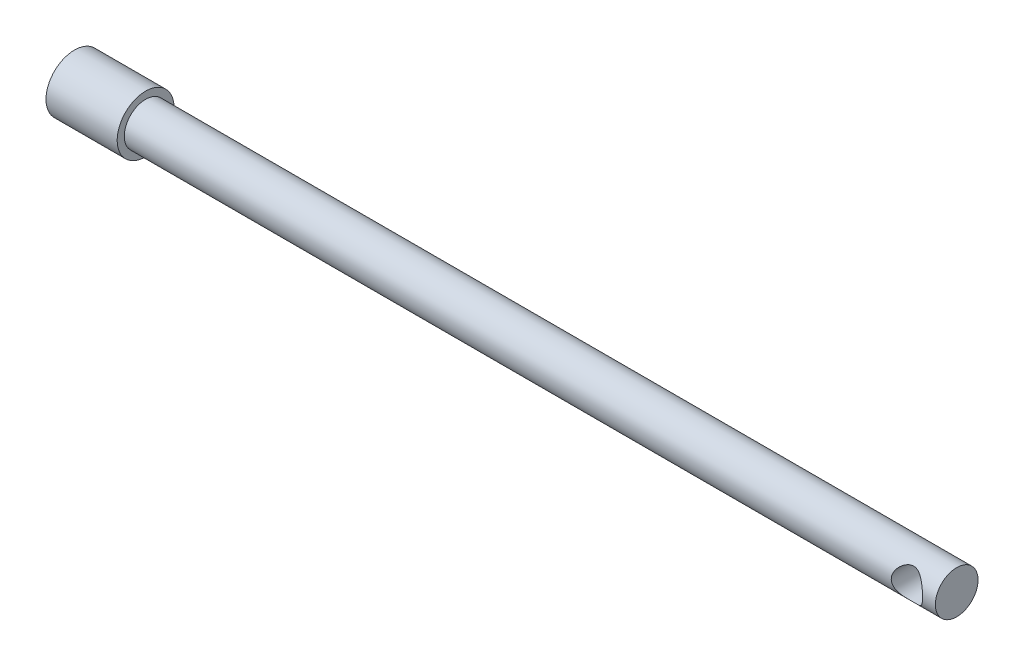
ISO-10303-21;
HEADER;
FILE_DESCRIPTION(('STEP AP214'),'2;1');
FILE_NAME('part.step','',(''),(''),'','','');
FILE_SCHEMA(('AUTOMOTIVE_DESIGN { 1 0 10303 214 1 1 1 1 }'));
ENDSEC;
DATA;
#1=APPLICATION_CONTEXT('core data for automotive mechanical design processes');
#2=APPLICATION_PROTOCOL_DEFINITION('international standard','automotive_design',2000,#1);
#3=PRODUCT_CONTEXT('',#1,'mechanical');
#4=PRODUCT('Part','Part','',(#3));
#5=PRODUCT_RELATED_PRODUCT_CATEGORY('part','',(#4));
#6=PRODUCT_DEFINITION_FORMATION('','',#4);
#7=PRODUCT_DEFINITION_CONTEXT('part definition',#1,'design');
#8=PRODUCT_DEFINITION('design','',#6,#7);
#9=PRODUCT_DEFINITION_SHAPE('','',#8);
#10=(LENGTH_UNIT() NAMED_UNIT(*) SI_UNIT(.MILLI.,.METRE.));
#11=(NAMED_UNIT(*) PLANE_ANGLE_UNIT() SI_UNIT($,.RADIAN.));
#12=(NAMED_UNIT(*) SI_UNIT($,.STERADIAN.) SOLID_ANGLE_UNIT());
#13=UNCERTAINTY_MEASURE_WITH_UNIT(LENGTH_MEASURE(1.E-05),#10,'distance_accuracy_value','');
#14=(GEOMETRIC_REPRESENTATION_CONTEXT(3) GLOBAL_UNCERTAINTY_ASSIGNED_CONTEXT((#13)) GLOBAL_UNIT_ASSIGNED_CONTEXT((#10,
#11,#12)) REPRESENTATION_CONTEXT('',''));
#15=CARTESIAN_POINT('',(0.,0.,0.));
#16=DIRECTION('',(0.,0.,1.));
#17=DIRECTION('',(1.,0.,0.));
#18=AXIS2_PLACEMENT_3D('',#15,#16,#17);
#19=CARTESIAN_POINT('',(-600.,0.,0.));
#20=DIRECTION('',(1.,0.,0.));
#21=DIRECTION('',(0.,0.,-1.));
#22=AXIS2_PLACEMENT_3D('',#19,#20,#21);
#23=PLANE('',#22);
#24=CARTESIAN_POINT('',(-600.,0.,0.));
#25=DIRECTION('',(-1.,0.,0.));
#26=DIRECTION('',(0.,0.,1.));
#27=AXIS2_PLACEMENT_3D('',#24,#25,#26);
#28=CIRCLE('',#27,20.);
#29=CARTESIAN_POINT('',(-600.,0.,20.));
#30=VERTEX_POINT('',#29);
#31=EDGE_CURVE('E18',#30,#30,#28,.F.);
#32=ORIENTED_EDGE('',*,*,#31,.F.);
#33=EDGE_LOOP('',(#32));
#34=FACE_BOUND('',#33,.T.);
#35=ADVANCED_FACE('F13',(#34),#23,.F.);
#36=CARTESIAN_POINT('',(-550.,0.,0.));
#37=DIRECTION('',(-1.,0.,0.));
#38=DIRECTION('',(0.,0.,1.));
#39=AXIS2_PLACEMENT_3D('',#36,#37,#38);
#40=CYLINDRICAL_SURFACE('',#39,20.);
#41=ORIENTED_EDGE('',*,*,#31,.T.);
#42=EDGE_LOOP('',(#41));
#43=FACE_BOUND('',#42,.T.);
#44=CARTESIAN_POINT('',(-550.,0.,0.));
#45=DIRECTION('',(-1.,0.,0.));
#46=DIRECTION('',(0.,0.,1.));
#47=AXIS2_PLACEMENT_3D('',#44,#45,#46);
#48=CIRCLE('',#47,20.);
#49=CARTESIAN_POINT('',(-550.,0.,20.));
#50=VERTEX_POINT('',#49);
#51=EDGE_CURVE('E46',#50,#50,#48,.T.);
#52=ORIENTED_EDGE('',*,*,#51,.T.);
#53=EDGE_LOOP('',(#52));
#54=FACE_BOUND('',#53,.T.);
#55=ADVANCED_FACE('F53',(#43,#54),#40,.T.);
#56=CARTESIAN_POINT('',(20.,0.,0.));
#57=DIRECTION('',(1.,0.,0.));
#58=DIRECTION('',(0.,0.,-1.));
#59=AXIS2_PLACEMENT_3D('',#56,#57,#58);
#60=PLANE('',#59);
#61=CARTESIAN_POINT('',(20.,0.,0.));
#62=DIRECTION('',(-1.,0.,0.));
#63=DIRECTION('',(0.,0.,1.));
#64=AXIS2_PLACEMENT_3D('',#61,#62,#63);
#65=CIRCLE('',#64,15.);
#66=CARTESIAN_POINT('',(20.,0.,15.));
#67=VERTEX_POINT('',#66);
#68=EDGE_CURVE('E44',#67,#67,#65,.T.);
#69=ORIENTED_EDGE('',*,*,#68,.F.);
#70=EDGE_LOOP('',(#69));
#71=FACE_BOUND('',#70,.T.);
#72=ADVANCED_FACE('F61',(#71),#60,.T.);
#73=CARTESIAN_POINT('',(-550.,0.,0.));
#74=DIRECTION('',(-1.,0.,0.));
#75=DIRECTION('',(0.,0.,1.));
#76=AXIS2_PLACEMENT_3D('',#73,#74,#75);
#77=PLANE('',#76);
#78=CARTESIAN_POINT('',(-550.,0.,0.));
#79=DIRECTION('',(-1.,0.,0.));
#80=DIRECTION('',(0.,0.,1.));
#81=AXIS2_PLACEMENT_3D('',#78,#79,#80);
#82=CIRCLE('',#81,15.);
#83=CARTESIAN_POINT('',(-550.,0.,15.));
#84=VERTEX_POINT('',#83);
#85=EDGE_CURVE('E22',#84,#84,#82,.F.);
#86=ORIENTED_EDGE('',*,*,#85,.F.);
#87=EDGE_LOOP('',(#86));
#88=FACE_BOUND('',#87,.T.);
#89=ORIENTED_EDGE('',*,*,#51,.F.);
#90=EDGE_LOOP('',(#89));
#91=FACE_BOUND('',#90,.T.);
#92=ADVANCED_FACE('F36',(#88,#91),#77,.F.);
#93=CARTESIAN_POINT('',(0.,0.,-15.));
#94=DIRECTION('',(0.,0.,1.));
#95=DIRECTION('',(1.,0.,0.));
#96=AXIS2_PLACEMENT_3D('',#93,#94,#95);
#97=CYLINDRICAL_SURFACE('',#96,11.);
#98=CARTESIAN_POINT('',(11.,0.,-15.));
#99=CARTESIAN_POINT('',(10.9999989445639,0.270234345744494,-14.9999989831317));
#100=CARTESIAN_POINT('',(10.9900265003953,0.540485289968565,-14.9926814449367));
#101=CARTESIAN_POINT('',(10.950295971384,1.07885095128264,-14.963582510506));
#102=CARTESIAN_POINT('',(10.9205289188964,1.34696464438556,-14.9417945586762));
#103=CARTESIAN_POINT('',(10.8416275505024,1.87926318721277,-14.8842251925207));
#104=CARTESIAN_POINT('',(10.792460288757,2.14344055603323,-14.8484199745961));
#105=CARTESIAN_POINT('',(10.6755308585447,2.66544248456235,-14.7636492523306));
#106=CARTESIAN_POINT('',(10.60777051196,2.92326766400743,-14.7146850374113));
#107=CARTESIAN_POINT('',(10.455056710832,3.42947281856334,-14.6049788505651));
#108=CARTESIAN_POINT('',(10.3702054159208,3.67789896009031,-14.5443069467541));
#109=CARTESIAN_POINT('',(10.1841148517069,4.16556445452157,-14.4122135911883));
#110=CARTESIAN_POINT('',(10.0828752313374,4.40480361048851,-14.3407919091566));
#111=CARTESIAN_POINT('',(9.86513916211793,4.87295052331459,-14.1885487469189));
#112=CARTESIAN_POINT('',(9.7486501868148,5.10186326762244,-14.1077318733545));
#113=CARTESIAN_POINT('',(9.50137535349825,5.5487947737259,-13.9380072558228));
#114=CARTESIAN_POINT('',(9.37058417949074,5.76680944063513,-13.8490965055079));
#115=CARTESIAN_POINT('',(9.08316785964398,6.21065135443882,-13.6561916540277));
#116=CARTESIAN_POINT('',(8.92527466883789,6.4353804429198,-13.5515613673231));
#117=CARTESIAN_POINT('',(8.59474679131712,6.8705899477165,-13.3361895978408));
#118=CARTESIAN_POINT('',(8.42211168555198,7.08106995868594,-13.2254479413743));
#119=CARTESIAN_POINT('',(8.06272673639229,7.48773584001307,-12.9995381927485));
#120=CARTESIAN_POINT('',(7.87595550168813,7.68389912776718,-12.8843635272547));
#121=CARTESIAN_POINT('',(7.48928883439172,8.06123556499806,-12.6517037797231));
#122=CARTESIAN_POINT('',(7.28939585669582,8.242411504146,-12.5342191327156));
#123=CARTESIAN_POINT('',(6.83682363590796,8.62331346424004,-12.2760403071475));
#124=CARTESIAN_POINT('',(6.58144005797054,8.81979231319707,-12.1352768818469));
#125=CARTESIAN_POINT('',(6.05311944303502,9.19042440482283,-11.8570571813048));
#126=CARTESIAN_POINT('',(5.7801773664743,9.36457119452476,-11.7196018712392));
#127=CARTESIAN_POINT('',(5.21744212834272,9.68936187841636,-11.4525286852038));
#128=CARTESIAN_POINT('',(4.92766801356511,9.84003165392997,-11.3229022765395));
#129=CARTESIAN_POINT('',(4.33141573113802,10.1166556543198,-11.076442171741));
#130=CARTESIAN_POINT('',(4.02494703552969,10.242623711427,-10.9596013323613));
#131=CARTESIAN_POINT('',(3.50094853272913,10.4303850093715,-10.7804394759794));
#132=CARTESIAN_POINT('',(3.28782250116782,10.4995737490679,-10.7129270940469));
#133=CARTESIAN_POINT('',(2.85500800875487,10.625426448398,-10.5881143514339));
#134=CARTESIAN_POINT('',(2.6353216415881,10.6820943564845,-10.5308107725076));
#135=CARTESIAN_POINT('',(2.19056026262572,10.7820819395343,-10.4284147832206));
#136=CARTESIAN_POINT('',(1.9654960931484,10.8254263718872,-10.3832997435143));
#137=CARTESIAN_POINT('',(1.51077883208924,10.8981901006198,-10.3069029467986));
#138=CARTESIAN_POINT('',(1.28112576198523,10.9276094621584,-10.2756211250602));
#139=CARTESIAN_POINT('',(0.817016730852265,10.9721120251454,-10.2280907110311));
#140=CARTESIAN_POINT('',(0.582537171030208,10.9870802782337,-10.2119626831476));
#141=CARTESIAN_POINT('',(0.112548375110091,11.0019364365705,-10.1959559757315));
#142=CARTESIAN_POINT('',(-0.122960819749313,11.0018249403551,-10.1960766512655));
#143=CARTESIAN_POINT('',(-0.593049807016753,10.9865203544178,-10.2125654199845));
#144=CARTESIAN_POINT('',(-0.827628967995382,10.9713183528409,-10.2289431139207));
#145=CARTESIAN_POINT('',(-1.29374843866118,10.9261645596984,-10.2771594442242));
#146=CARTESIAN_POINT('',(-1.52528840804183,10.8962111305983,-10.3089997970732));
#147=CARTESIAN_POINT('',(-2.00856310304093,10.8181280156,-10.3909399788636));
#148=CARTESIAN_POINT('',(-2.25976351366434,10.7683789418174,-10.4426460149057));
#149=CARTESIAN_POINT('',(-2.75472374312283,10.6525201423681,-10.5608080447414));
#150=CARTESIAN_POINT('',(-2.99848250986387,10.5864081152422,-10.6272661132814));
#151=CARTESIAN_POINT('',(-3.71799960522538,10.3647718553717,-10.8450088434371));
#152=CARTESIAN_POINT('',(-4.18133061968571,10.1860595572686,-11.0145361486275));
#153=CARTESIAN_POINT('',(-4.92554456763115,9.84116811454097,-11.3219366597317));
#154=CARTESIAN_POINT('',(-5.2168211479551,9.68975954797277,-11.4522158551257));
#155=CARTESIAN_POINT('',(-5.78225957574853,9.36333004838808,-11.7206082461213));
#156=CARTESIAN_POINT('',(-6.05641582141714,9.18830144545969,-11.8587239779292));
#157=CARTESIAN_POINT('',(-6.58728128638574,8.81550158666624,-12.1384232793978));
#158=CARTESIAN_POINT('',(-6.8439744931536,8.61770989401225,-12.2800098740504));
#159=CARTESIAN_POINT('',(-7.33908375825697,8.20016329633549,-12.562678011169));
#160=CARTESIAN_POINT('',(-7.57750193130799,7.9804109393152,-12.7037596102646));
#161=CARTESIAN_POINT('',(-8.03836541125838,7.51619216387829,-12.9838893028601));
#162=CARTESIAN_POINT('',(-8.26054003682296,7.27142254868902,-13.1228811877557));
#163=CARTESIAN_POINT('',(-8.68379183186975,6.76031353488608,-13.3933474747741));
#164=CARTESIAN_POINT('',(-8.88486659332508,6.4939716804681,-13.5248210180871));
#165=CARTESIAN_POINT('',(-9.26374282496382,5.9409781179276,-13.7766812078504));
#166=CARTESIAN_POINT('',(-9.44158119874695,5.65435975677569,-13.8970853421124));
#167=CARTESIAN_POINT('',(-9.7721047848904,5.06171559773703,-14.1237235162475));
#168=CARTESIAN_POINT('',(-9.92480016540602,4.75569771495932,-14.2299632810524));
#169=CARTESIAN_POINT('',(-10.1671126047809,4.20659794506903,-14.4001660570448));
#170=CARTESIAN_POINT('',(-10.2628788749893,3.96740850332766,-14.4679959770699));
#171=CARTESIAN_POINT('',(-10.4380921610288,3.48039642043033,-14.5928058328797));
#172=CARTESIAN_POINT('',(-10.5175428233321,3.2325757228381,-14.649788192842));
#173=CARTESIAN_POINT('',(-10.659004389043,2.73012906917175,-14.7516769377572));
#174=CARTESIAN_POINT('',(-10.7210502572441,2.47551789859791,-14.7966075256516));
#175=CARTESIAN_POINT('',(-10.8270300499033,1.96072320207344,-14.8735755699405));
#176=CARTESIAN_POINT('',(-10.87097136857,1.70054199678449,-14.9056182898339));
#177=CARTESIAN_POINT('',(-10.9368839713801,1.20084572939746,-14.953761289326));
#178=CARTESIAN_POINT('',(-10.9605217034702,0.961665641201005,-14.9710694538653));
#179=CARTESIAN_POINT('',(-10.9920819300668,0.481661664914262,-14.994190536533));
#180=CARTESIAN_POINT('',(-11.0000009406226,0.240837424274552,-15.0000009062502));
#181=CARTESIAN_POINT('',(-10.9999989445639,-0.270234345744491,-14.9999989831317));
#182=CARTESIAN_POINT('',(-10.9900265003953,-0.540485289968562,-14.9926814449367));
#183=CARTESIAN_POINT('',(-10.950295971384,-1.07885095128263,-14.963582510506));
#184=CARTESIAN_POINT('',(-10.9205289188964,-1.34696464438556,-14.9417945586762));
#185=CARTESIAN_POINT('',(-10.8416275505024,-1.87926318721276,-14.8842251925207));
#186=CARTESIAN_POINT('',(-10.792460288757,-2.14344055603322,-14.8484199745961));
#187=CARTESIAN_POINT('',(-10.6755308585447,-2.66544248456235,-14.7636492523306));
#188=CARTESIAN_POINT('',(-10.60777051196,-2.92326766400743,-14.7146850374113));
#189=CARTESIAN_POINT('',(-10.455056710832,-3.42947281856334,-14.6049788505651));
#190=CARTESIAN_POINT('',(-10.3702054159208,-3.67789896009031,-14.5443069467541));
#191=CARTESIAN_POINT('',(-10.1841148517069,-4.16556445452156,-14.4122135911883));
#192=CARTESIAN_POINT('',(-10.0828752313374,-4.40480361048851,-14.3407919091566));
#193=CARTESIAN_POINT('',(-9.86513916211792,-4.87295052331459,-14.1885487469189));
#194=CARTESIAN_POINT('',(-9.7486501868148,-5.10186326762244,-14.1077318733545));
#195=CARTESIAN_POINT('',(-9.50137535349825,-5.5487947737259,-13.9380072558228));
#196=CARTESIAN_POINT('',(-9.37058417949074,-5.76680944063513,-13.8490965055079));
#197=CARTESIAN_POINT('',(-9.08316785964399,-6.21065135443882,-13.6561916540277));
#198=CARTESIAN_POINT('',(-8.92527466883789,-6.4353804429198,-13.5515613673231));
#199=CARTESIAN_POINT('',(-8.59474679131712,-6.8705899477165,-13.3361895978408));
#200=CARTESIAN_POINT('',(-8.42211168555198,-7.08106995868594,-13.2254479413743));
#201=CARTESIAN_POINT('',(-8.06272673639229,-7.48773584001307,-12.9995381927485));
#202=CARTESIAN_POINT('',(-7.87595550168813,-7.68389912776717,-12.8843635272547));
#203=CARTESIAN_POINT('',(-7.48928883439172,-8.06123556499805,-12.6517037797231));
#204=CARTESIAN_POINT('',(-7.28939585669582,-8.242411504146,-12.5342191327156));
#205=CARTESIAN_POINT('',(-6.83682363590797,-8.62331346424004,-12.2760403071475));
#206=CARTESIAN_POINT('',(-6.58144005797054,-8.81979231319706,-12.1352768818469));
#207=CARTESIAN_POINT('',(-6.05311944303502,-9.19042440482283,-11.8570571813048));
#208=CARTESIAN_POINT('',(-5.78017736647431,-9.36457119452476,-11.7196018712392));
#209=CARTESIAN_POINT('',(-5.21744212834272,-9.68936187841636,-11.4525286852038));
#210=CARTESIAN_POINT('',(-4.92766801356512,-9.84003165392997,-11.3229022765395));
#211=CARTESIAN_POINT('',(-4.33141573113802,-10.1166556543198,-11.076442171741));
#212=CARTESIAN_POINT('',(-4.02494703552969,-10.242623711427,-10.9596013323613));
#213=CARTESIAN_POINT('',(-3.50094853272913,-10.4303850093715,-10.7804394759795));
#214=CARTESIAN_POINT('',(-3.28782250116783,-10.4995737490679,-10.7129270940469));
#215=CARTESIAN_POINT('',(-2.85500800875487,-10.625426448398,-10.5881143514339));
#216=CARTESIAN_POINT('',(-2.63532164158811,-10.6820943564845,-10.5308107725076));
#217=CARTESIAN_POINT('',(-2.19056026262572,-10.7820819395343,-10.4284147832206));
#218=CARTESIAN_POINT('',(-1.9654960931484,-10.8254263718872,-10.3832997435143));
#219=CARTESIAN_POINT('',(-1.51077883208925,-10.8981901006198,-10.3069029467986));
#220=CARTESIAN_POINT('',(-1.28112576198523,-10.9276094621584,-10.2756211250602));
#221=CARTESIAN_POINT('',(-0.817016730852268,-10.9721120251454,-10.2280907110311));
#222=CARTESIAN_POINT('',(-0.582537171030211,-10.9870802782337,-10.2119626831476));
#223=CARTESIAN_POINT('',(-0.112548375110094,-11.0019364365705,-10.1959559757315));
#224=CARTESIAN_POINT('',(0.12296081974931,-11.0018249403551,-10.1960766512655));
#225=CARTESIAN_POINT('',(0.593049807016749,-10.9865203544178,-10.2125654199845));
#226=CARTESIAN_POINT('',(0.827628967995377,-10.9713183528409,-10.2289431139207));
#227=CARTESIAN_POINT('',(1.29374843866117,-10.9261645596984,-10.2771594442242));
#228=CARTESIAN_POINT('',(1.52528840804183,-10.8962111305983,-10.3089997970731));
#229=CARTESIAN_POINT('',(2.00856310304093,-10.8181280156,-10.3909399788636));
#230=CARTESIAN_POINT('',(2.25976351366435,-10.7683789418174,-10.4426460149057));
#231=CARTESIAN_POINT('',(2.75472374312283,-10.652520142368,-10.5608080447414));
#232=CARTESIAN_POINT('',(2.99848250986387,-10.5864081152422,-10.6272661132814));
#233=CARTESIAN_POINT('',(3.71799960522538,-10.3647718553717,-10.8450088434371));
#234=CARTESIAN_POINT('',(4.1813306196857,-10.1860595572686,-11.0145361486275));
#235=CARTESIAN_POINT('',(4.92554456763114,-9.84116811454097,-11.3219366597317));
#236=CARTESIAN_POINT('',(5.21682114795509,-9.68975954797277,-11.4522158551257));
#237=CARTESIAN_POINT('',(5.78225957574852,-9.36333004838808,-11.7206082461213));
#238=CARTESIAN_POINT('',(6.05641582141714,-9.1883014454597,-11.8587239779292));
#239=CARTESIAN_POINT('',(6.58728128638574,-8.81550158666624,-12.1384232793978));
#240=CARTESIAN_POINT('',(6.84397449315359,-8.61770989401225,-12.2800098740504));
#241=CARTESIAN_POINT('',(7.33908375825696,-8.20016329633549,-12.562678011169));
#242=CARTESIAN_POINT('',(7.57750193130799,-7.9804109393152,-12.7037596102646));
#243=CARTESIAN_POINT('',(8.03836541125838,-7.51619216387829,-12.9838893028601));
#244=CARTESIAN_POINT('',(8.26054003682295,-7.27142254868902,-13.1228811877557));
#245=CARTESIAN_POINT('',(8.68379183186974,-6.76031353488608,-13.3933474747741));
#246=CARTESIAN_POINT('',(8.88486659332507,-6.49397168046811,-13.5248210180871));
#247=CARTESIAN_POINT('',(9.26374282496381,-5.94097811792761,-13.7766812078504));
#248=CARTESIAN_POINT('',(9.44158119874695,-5.6543597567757,-13.8970853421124));
#249=CARTESIAN_POINT('',(9.7721047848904,-5.06171559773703,-14.1237235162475));
#250=CARTESIAN_POINT('',(9.92480016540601,-4.75569771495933,-14.2299632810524));
#251=CARTESIAN_POINT('',(10.1671126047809,-4.20659794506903,-14.4001660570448));
#252=CARTESIAN_POINT('',(10.2628788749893,-3.96740850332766,-14.4679959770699));
#253=CARTESIAN_POINT('',(10.4380921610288,-3.48039642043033,-14.5928058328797));
#254=CARTESIAN_POINT('',(10.5175428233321,-3.2325757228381,-14.649788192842));
#255=CARTESIAN_POINT('',(10.659004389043,-2.73012906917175,-14.7516769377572));
#256=CARTESIAN_POINT('',(10.7210502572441,-2.47551789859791,-14.7966075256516));
#257=CARTESIAN_POINT('',(10.8270300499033,-1.96072320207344,-14.8735755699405));
#258=CARTESIAN_POINT('',(10.87097136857,-1.7005419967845,-14.9056182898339));
#259=CARTESIAN_POINT('',(10.9368839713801,-1.20084572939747,-14.953761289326));
#260=CARTESIAN_POINT('',(10.9605217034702,-0.961665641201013,-14.9710694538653));
#261=CARTESIAN_POINT('',(10.9920819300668,-0.481661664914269,-14.994190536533));
#262=CARTESIAN_POINT('',(11.0000009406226,-0.240837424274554,-15.0000009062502));
#263=CARTESIAN_POINT('',(11.,0.,-15.));
#264=B_SPLINE_CURVE_WITH_KNOTS('',3,(#98,#99,#100,#101,#102,#103,#104,#105,#106,#107,#108,#109,
#110,#111,#112,#113,#114,#115,#116,#117,#118,#119,#120,#121,#122,#123,#124,#125,#126,#127,#128,
#129,#130,#131,#132,#133,#134,#135,#136,#137,#138,#139,#140,#141,#142,#143,#144,#145,#146,#147,
#148,#149,#150,#151,#152,#153,#154,#155,#156,#157,#158,#159,#160,#161,#162,#163,#164,#165,#166,
#167,#168,#169,#170,#171,#172,#173,#174,#175,#176,#177,#178,#179,#180,#181,#182,#183,#184,#185,
#186,#187,#188,#189,#190,#191,#192,#193,#194,#195,#196,#197,#198,#199,#200,#201,#202,#203,#204,
#205,#206,#207,#208,#209,#210,#211,#212,#213,#214,#215,#216,#217,#218,#219,#220,#221,#222,#223,
#224,#225,#226,#227,#228,#229,#230,#231,#232,#233,#234,#235,#236,#237,#238,#239,#240,#241,#242,
#243,#244,#245,#246,#247,#248,#249,#250,#251,#252,#253,#254,#255,#256,#257,#258,#259,#260,#261,
#262,#263),.UNSPECIFIED.,.T.,.F.,(4,2,2,2,2,2,2,2,2,2,2,2,2,2,2,2,2,2,2,2,2,2,2,2,2,2,2,2,2,2,2,
2,2,2,2,2,2,2,2,2,2,2,2,2,2,2,2,2,2,2,2,2,2,2,2,2,2,2,2,2,2,2,2,2,2,2,2,2,2,2,2,2,2,2,2,2,2,2,2,
2,2,2,4),(0.,0.810451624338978,1.62127066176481,2.43347261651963,3.245595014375,
4.05299986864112,4.86042202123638,5.66744993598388,6.4747788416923,7.35566894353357,
8.23658409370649,9.11886000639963,10.0009713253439,11.0546742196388,12.1086809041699,
13.1615172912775,14.2137624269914,14.9152774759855,15.6165709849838,16.3165533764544,
17.0165324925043,17.7220346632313,18.4275088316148,19.1333998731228,19.8393692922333,
20.6219293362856,21.4045995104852,22.9719812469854,24.0304577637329,25.0892788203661,
26.1490580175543,27.2087143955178,28.2832214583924,29.3578510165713,30.4307525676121,
31.5032191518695,32.301720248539,33.100042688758,33.8967496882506,34.6931309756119,
35.4152591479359,36.1375473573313,36.9479989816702,37.7588180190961,38.5710199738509,
39.3831423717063,40.1905472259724,40.9979693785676,41.8049972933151,42.6123261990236,
43.4932163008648,44.3741314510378,45.2564073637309,46.1385186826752,47.1922215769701,
48.2462282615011,49.2990646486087,50.3513097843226,51.0528248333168,51.7541183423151,
52.4541007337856,53.1540798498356,53.8595820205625,54.5650561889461,55.2709472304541,
55.9769166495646,56.7594766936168,57.5421468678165,59.1095286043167,60.1680051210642,
61.2268261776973,62.2866053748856,63.3462617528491,64.4207688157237,65.4953983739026,
66.5682999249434,67.6407665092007,68.4392676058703,69.2375900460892,70.0342970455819,
70.8306783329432,71.5528065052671,72.2750947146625),.UNSPECIFIED.);
#265=CARTESIAN_POINT('',(11.,0.,-15.));
#266=VERTEX_POINT('',#265);
#267=EDGE_CURVE('E27',#266,#266,#264,.T.);
#268=ORIENTED_EDGE('',*,*,#267,.F.);
#269=EDGE_LOOP('',(#268));
#270=FACE_BOUND('',#269,.T.);
#271=CARTESIAN_POINT('',(-11.,0.,15.));
#272=CARTESIAN_POINT('',(-10.9999989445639,0.270234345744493,14.9999989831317));
#273=CARTESIAN_POINT('',(-10.9900265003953,0.540485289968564,14.9926814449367));
#274=CARTESIAN_POINT('',(-10.950295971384,1.07885095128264,14.963582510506));
#275=CARTESIAN_POINT('',(-10.9205289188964,1.34696464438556,14.9417945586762));
#276=CARTESIAN_POINT('',(-10.8416275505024,1.87926318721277,14.8842251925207));
#277=CARTESIAN_POINT('',(-10.792460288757,2.14344055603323,14.8484199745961));
#278=CARTESIAN_POINT('',(-10.6755308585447,2.66544248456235,14.7636492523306));
#279=CARTESIAN_POINT('',(-10.60777051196,2.92326766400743,14.7146850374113));
#280=CARTESIAN_POINT('',(-10.455056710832,3.42947281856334,14.6049788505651));
#281=CARTESIAN_POINT('',(-10.3702054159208,3.67789896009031,14.5443069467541));
#282=CARTESIAN_POINT('',(-10.1841148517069,4.16556445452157,14.4122135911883));
#283=CARTESIAN_POINT('',(-10.0828752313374,4.40480361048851,14.3407919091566));
#284=CARTESIAN_POINT('',(-9.86513916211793,4.87295052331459,14.1885487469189));
#285=CARTESIAN_POINT('',(-9.7486501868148,5.10186326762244,14.1077318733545));
#286=CARTESIAN_POINT('',(-9.50137535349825,5.5487947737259,13.9380072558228));
#287=CARTESIAN_POINT('',(-9.37058417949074,5.76680944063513,13.8490965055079));
#288=CARTESIAN_POINT('',(-9.08316785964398,6.21065135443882,13.6561916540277));
#289=CARTESIAN_POINT('',(-8.92527466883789,6.4353804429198,13.5515613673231));
#290=CARTESIAN_POINT('',(-8.59474679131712,6.8705899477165,13.3361895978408));
#291=CARTESIAN_POINT('',(-8.42211168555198,7.08106995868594,13.2254479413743));
#292=CARTESIAN_POINT('',(-8.06272673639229,7.48773584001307,12.9995381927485));
#293=CARTESIAN_POINT('',(-7.87595550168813,7.68389912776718,12.8843635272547));
#294=CARTESIAN_POINT('',(-7.48928883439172,8.06123556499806,12.6517037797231));
#295=CARTESIAN_POINT('',(-7.28939585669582,8.242411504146,12.5342191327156));
#296=CARTESIAN_POINT('',(-6.83682363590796,8.62331346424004,12.2760403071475));
#297=CARTESIAN_POINT('',(-6.58144005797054,8.81979231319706,12.1352768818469));
#298=CARTESIAN_POINT('',(-6.05311944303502,9.19042440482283,11.8570571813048));
#299=CARTESIAN_POINT('',(-5.7801773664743,9.36457119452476,11.7196018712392));
#300=CARTESIAN_POINT('',(-5.21744212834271,9.68936187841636,11.4525286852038));
#301=CARTESIAN_POINT('',(-4.92766801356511,9.84003165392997,11.3229022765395));
#302=CARTESIAN_POINT('',(-4.33141573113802,10.1166556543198,11.076442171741));
#303=CARTESIAN_POINT('',(-4.02494703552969,10.242623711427,10.9596013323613));
#304=CARTESIAN_POINT('',(-3.50094853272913,10.4303850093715,10.7804394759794));
#305=CARTESIAN_POINT('',(-3.28782250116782,10.4995737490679,10.7129270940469));
#306=CARTESIAN_POINT('',(-2.85500800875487,10.625426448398,10.5881143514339));
#307=CARTESIAN_POINT('',(-2.6353216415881,10.6820943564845,10.5308107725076));
#308=CARTESIAN_POINT('',(-2.19056026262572,10.7820819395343,10.4284147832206));
#309=CARTESIAN_POINT('',(-1.9654960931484,10.8254263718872,10.3832997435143));
#310=CARTESIAN_POINT('',(-1.51077883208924,10.8981901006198,10.3069029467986));
#311=CARTESIAN_POINT('',(-1.28112576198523,10.9276094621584,10.2756211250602));
#312=CARTESIAN_POINT('',(-0.817016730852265,10.9721120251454,10.2280907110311));
#313=CARTESIAN_POINT('',(-0.582537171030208,10.9870802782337,10.2119626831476));
#314=CARTESIAN_POINT('',(-0.112548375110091,11.0019364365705,10.1959559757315));
#315=CARTESIAN_POINT('',(0.122960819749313,11.0018249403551,10.1960766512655));
#316=CARTESIAN_POINT('',(0.593049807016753,10.9865203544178,10.2125654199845));
#317=CARTESIAN_POINT('',(0.827628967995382,10.9713183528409,10.2289431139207));
#318=CARTESIAN_POINT('',(1.29374843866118,10.9261645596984,10.2771594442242));
#319=CARTESIAN_POINT('',(1.52528840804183,10.8962111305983,10.3089997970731));
#320=CARTESIAN_POINT('',(2.00856310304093,10.8181280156,10.3909399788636));
#321=CARTESIAN_POINT('',(2.25976351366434,10.7683789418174,10.4426460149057));
#322=CARTESIAN_POINT('',(2.75472374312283,10.652520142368,10.5608080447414));
#323=CARTESIAN_POINT('',(2.99848250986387,10.5864081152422,10.6272661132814));
#324=CARTESIAN_POINT('',(3.71799960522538,10.3647718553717,10.8450088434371));
#325=CARTESIAN_POINT('',(4.18133061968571,10.1860595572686,11.0145361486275));
#326=CARTESIAN_POINT('',(4.92554456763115,9.84116811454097,11.3219366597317));
#327=CARTESIAN_POINT('',(5.2168211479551,9.68975954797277,11.4522158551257));
#328=CARTESIAN_POINT('',(5.78225957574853,9.36333004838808,11.7206082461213));
#329=CARTESIAN_POINT('',(6.05641582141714,9.18830144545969,11.8587239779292));
#330=CARTESIAN_POINT('',(6.58728128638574,8.81550158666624,12.1384232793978));
#331=CARTESIAN_POINT('',(6.8439744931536,8.61770989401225,12.2800098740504));
#332=CARTESIAN_POINT('',(7.33908375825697,8.20016329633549,12.562678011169));
#333=CARTESIAN_POINT('',(7.57750193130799,7.9804109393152,12.7037596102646));
#334=CARTESIAN_POINT('',(8.03836541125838,7.51619216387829,12.9838893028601));
#335=CARTESIAN_POINT('',(8.26054003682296,7.27142254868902,13.1228811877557));
#336=CARTESIAN_POINT('',(8.68379183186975,6.76031353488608,13.3933474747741));
#337=CARTESIAN_POINT('',(8.88486659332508,6.4939716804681,13.5248210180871));
#338=CARTESIAN_POINT('',(9.26374282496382,5.9409781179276,13.7766812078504));
#339=CARTESIAN_POINT('',(9.44158119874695,5.65435975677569,13.8970853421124));
#340=CARTESIAN_POINT('',(9.7721047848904,5.06171559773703,14.1237235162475));
#341=CARTESIAN_POINT('',(9.92480016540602,4.75569771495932,14.2299632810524));
#342=CARTESIAN_POINT('',(10.1671126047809,4.20659794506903,14.4001660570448));
#343=CARTESIAN_POINT('',(10.2628788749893,3.96740850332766,14.4679959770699));
#344=CARTESIAN_POINT('',(10.4380921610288,3.48039642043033,14.5928058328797));
#345=CARTESIAN_POINT('',(10.5175428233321,3.2325757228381,14.649788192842));
#346=CARTESIAN_POINT('',(10.659004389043,2.73012906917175,14.7516769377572));
#347=CARTESIAN_POINT('',(10.7210502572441,2.47551789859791,14.7966075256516));
#348=CARTESIAN_POINT('',(10.8270300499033,1.96072320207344,14.8735755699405));
#349=CARTESIAN_POINT('',(10.87097136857,1.70054199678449,14.9056182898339));
#350=CARTESIAN_POINT('',(10.9368839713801,1.20084572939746,14.953761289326));
#351=CARTESIAN_POINT('',(10.9605217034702,0.961665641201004,14.9710694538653));
#352=CARTESIAN_POINT('',(10.9920819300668,0.48166166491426,14.994190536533));
#353=CARTESIAN_POINT('',(11.0000009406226,0.24083742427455,15.0000009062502));
#354=CARTESIAN_POINT('',(10.9999989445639,-0.270234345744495,14.9999989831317));
#355=CARTESIAN_POINT('',(10.9900265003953,-0.540485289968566,14.9926814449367));
#356=CARTESIAN_POINT('',(10.950295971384,-1.07885095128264,14.963582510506));
#357=CARTESIAN_POINT('',(10.9205289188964,-1.34696464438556,14.9417945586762));
#358=CARTESIAN_POINT('',(10.8416275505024,-1.87926318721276,14.8842251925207));
#359=CARTESIAN_POINT('',(10.792460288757,-2.14344055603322,14.8484199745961));
#360=CARTESIAN_POINT('',(10.6755308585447,-2.66544248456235,14.7636492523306));
#361=CARTESIAN_POINT('',(10.60777051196,-2.92326766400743,14.7146850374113));
#362=CARTESIAN_POINT('',(10.455056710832,-3.42947281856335,14.6049788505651));
#363=CARTESIAN_POINT('',(10.3702054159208,-3.67789896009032,14.5443069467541));
#364=CARTESIAN_POINT('',(10.1841148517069,-4.16556445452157,14.4122135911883));
#365=CARTESIAN_POINT('',(10.0828752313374,-4.40480361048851,14.3407919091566));
#366=CARTESIAN_POINT('',(9.86513916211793,-4.87295052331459,14.1885487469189));
#367=CARTESIAN_POINT('',(9.7486501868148,-5.10186326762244,14.1077318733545));
#368=CARTESIAN_POINT('',(9.50137535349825,-5.54879477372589,13.9380072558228));
#369=CARTESIAN_POINT('',(9.37058417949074,-5.76680944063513,13.8490965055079));
#370=CARTESIAN_POINT('',(9.08316785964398,-6.21065135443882,13.6561916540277));
#371=CARTESIAN_POINT('',(8.92527466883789,-6.4353804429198,13.5515613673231));
#372=CARTESIAN_POINT('',(8.59474679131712,-6.8705899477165,13.3361895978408));
#373=CARTESIAN_POINT('',(8.42211168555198,-7.08106995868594,13.2254479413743));
#374=CARTESIAN_POINT('',(8.06272673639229,-7.48773584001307,12.9995381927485));
#375=CARTESIAN_POINT('',(7.87595550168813,-7.68389912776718,12.8843635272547));
#376=CARTESIAN_POINT('',(7.48928883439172,-8.06123556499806,12.6517037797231));
#377=CARTESIAN_POINT('',(7.28939585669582,-8.242411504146,12.5342191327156));
#378=CARTESIAN_POINT('',(6.83682363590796,-8.62331346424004,12.2760403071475));
#379=CARTESIAN_POINT('',(6.58144005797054,-8.81979231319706,12.1352768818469));
#380=CARTESIAN_POINT('',(6.05311944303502,-9.19042440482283,11.8570571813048));
#381=CARTESIAN_POINT('',(5.78017736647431,-9.36457119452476,11.7196018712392));
#382=CARTESIAN_POINT('',(5.21744212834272,-9.68936187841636,11.4525286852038));
#383=CARTESIAN_POINT('',(4.92766801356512,-9.84003165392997,11.3229022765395));
#384=CARTESIAN_POINT('',(4.33141573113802,-10.1166556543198,11.076442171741));
#385=CARTESIAN_POINT('',(4.02494703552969,-10.242623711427,10.9596013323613));
#386=CARTESIAN_POINT('',(3.50094853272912,-10.4303850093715,10.7804394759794));
#387=CARTESIAN_POINT('',(3.28782250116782,-10.4995737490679,10.7129270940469));
#388=CARTESIAN_POINT('',(2.85500800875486,-10.625426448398,10.5881143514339));
#389=CARTESIAN_POINT('',(2.6353216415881,-10.6820943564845,10.5308107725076));
#390=CARTESIAN_POINT('',(2.19056026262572,-10.7820819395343,10.4284147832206));
#391=CARTESIAN_POINT('',(1.9654960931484,-10.8254263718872,10.3832997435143));
#392=CARTESIAN_POINT('',(1.51077883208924,-10.8981901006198,10.3069029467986));
#393=CARTESIAN_POINT('',(1.28112576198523,-10.9276094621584,10.2756211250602));
#394=CARTESIAN_POINT('',(0.817016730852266,-10.9721120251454,10.2280907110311));
#395=CARTESIAN_POINT('',(0.58253717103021,-10.9870802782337,10.2119626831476));
#396=CARTESIAN_POINT('',(0.112548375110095,-11.0019364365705,10.1959559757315));
#397=CARTESIAN_POINT('',(-0.122960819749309,-11.0018249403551,10.1960766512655));
#398=CARTESIAN_POINT('',(-0.59304980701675,-10.9865203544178,10.2125654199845));
#399=CARTESIAN_POINT('',(-0.82762896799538,-10.9713183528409,10.2289431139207));
#400=CARTESIAN_POINT('',(-1.29374843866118,-10.9261645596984,10.2771594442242));
#401=CARTESIAN_POINT('',(-1.52528840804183,-10.8962111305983,10.3089997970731));
#402=CARTESIAN_POINT('',(-2.00856310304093,-10.8181280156,10.3909399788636));
#403=CARTESIAN_POINT('',(-2.25976351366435,-10.7683789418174,10.4426460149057));
#404=CARTESIAN_POINT('',(-2.75472374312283,-10.652520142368,10.5608080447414));
#405=CARTESIAN_POINT('',(-2.99848250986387,-10.5864081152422,10.6272661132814));
#406=CARTESIAN_POINT('',(-3.71799960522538,-10.3647718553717,10.8450088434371));
#407=CARTESIAN_POINT('',(-4.1813306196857,-10.1860595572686,11.0145361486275));
#408=CARTESIAN_POINT('',(-4.92554456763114,-9.84116811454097,11.3219366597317));
#409=CARTESIAN_POINT('',(-5.2168211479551,-9.68975954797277,11.4522158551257));
#410=CARTESIAN_POINT('',(-5.78225957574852,-9.36333004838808,11.7206082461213));
#411=CARTESIAN_POINT('',(-6.05641582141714,-9.1883014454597,11.8587239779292));
#412=CARTESIAN_POINT('',(-6.58728128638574,-8.81550158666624,12.1384232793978));
#413=CARTESIAN_POINT('',(-6.8439744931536,-8.61770989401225,12.2800098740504));
#414=CARTESIAN_POINT('',(-7.33908375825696,-8.20016329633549,12.562678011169));
#415=CARTESIAN_POINT('',(-7.57750193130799,-7.9804109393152,12.7037596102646));
#416=CARTESIAN_POINT('',(-8.03836541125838,-7.51619216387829,12.9838893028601));
#417=CARTESIAN_POINT('',(-8.26054003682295,-7.27142254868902,13.1228811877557));
#418=CARTESIAN_POINT('',(-8.68379183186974,-6.76031353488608,13.3933474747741));
#419=CARTESIAN_POINT('',(-8.88486659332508,-6.4939716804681,13.524821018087));
#420=CARTESIAN_POINT('',(-9.26374282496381,-5.9409781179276,13.7766812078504));
#421=CARTESIAN_POINT('',(-9.44158119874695,-5.6543597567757,13.8970853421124));
#422=CARTESIAN_POINT('',(-9.7721047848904,-5.06171559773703,14.1237235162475));
#423=CARTESIAN_POINT('',(-9.92480016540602,-4.75569771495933,14.2299632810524));
#424=CARTESIAN_POINT('',(-10.1671126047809,-4.20659794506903,14.4001660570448));
#425=CARTESIAN_POINT('',(-10.2628788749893,-3.96740850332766,14.4679959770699));
#426=CARTESIAN_POINT('',(-10.4380921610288,-3.48039642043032,14.5928058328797));
#427=CARTESIAN_POINT('',(-10.5175428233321,-3.2325757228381,14.649788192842));
#428=CARTESIAN_POINT('',(-10.659004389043,-2.73012906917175,14.7516769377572));
#429=CARTESIAN_POINT('',(-10.7210502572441,-2.47551789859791,14.7966075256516));
#430=CARTESIAN_POINT('',(-10.8270300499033,-1.96072320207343,14.8735755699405));
#431=CARTESIAN_POINT('',(-10.87097136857,-1.70054199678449,14.9056182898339));
#432=CARTESIAN_POINT('',(-10.9368839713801,-1.20084572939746,14.953761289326));
#433=CARTESIAN_POINT('',(-10.9605217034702,-0.961665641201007,14.9710694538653));
#434=CARTESIAN_POINT('',(-10.9920819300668,-0.481661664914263,14.994190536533));
#435=CARTESIAN_POINT('',(-11.0000009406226,-0.240837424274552,15.0000009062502));
#436=CARTESIAN_POINT('',(-11.,0.,15.));
#437=B_SPLINE_CURVE_WITH_KNOTS('',3,(#271,#272,#273,#274,#275,#276,#277,#278,#279,#280,#281,
#282,#283,#284,#285,#286,#287,#288,#289,#290,#291,#292,#293,#294,#295,#296,#297,#298,#299,#300,
#301,#302,#303,#304,#305,#306,#307,#308,#309,#310,#311,#312,#313,#314,#315,#316,#317,#318,#319,
#320,#321,#322,#323,#324,#325,#326,#327,#328,#329,#330,#331,#332,#333,#334,#335,#336,#337,#338,
#339,#340,#341,#342,#343,#344,#345,#346,#347,#348,#349,#350,#351,#352,#353,#354,#355,#356,#357,
#358,#359,#360,#361,#362,#363,#364,#365,#366,#367,#368,#369,#370,#371,#372,#373,#374,#375,#376,
#377,#378,#379,#380,#381,#382,#383,#384,#385,#386,#387,#388,#389,#390,#391,#392,#393,#394,#395,
#396,#397,#398,#399,#400,#401,#402,#403,#404,#405,#406,#407,#408,#409,#410,#411,#412,#413,#414,
#415,#416,#417,#418,#419,#420,#421,#422,#423,#424,#425,#426,#427,#428,#429,#430,#431,#432,#433,
#434,#435,#436),.UNSPECIFIED.,.T.,.F.,(4,2,2,2,2,2,2,2,2,2,2,2,2,2,2,2,2,2,2,2,2,2,2,2,2,2,2,2,
2,2,2,2,2,2,2,2,2,2,2,2,2,2,2,2,2,2,2,2,2,2,2,2,2,2,2,2,2,2,2,2,2,2,2,2,2,2,2,2,2,2,2,2,2,2,2,2,
2,2,2,2,2,2,4),(0.,0.810451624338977,1.62127066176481,2.43347261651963,3.245595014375,
4.05299986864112,4.86042202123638,5.66744993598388,6.4747788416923,7.35566894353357,
8.23658409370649,9.11886000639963,10.0009713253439,11.0546742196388,12.1086809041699,
13.1615172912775,14.2137624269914,14.9152774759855,15.6165709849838,16.3165533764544,
17.0165324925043,17.7220346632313,18.4275088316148,19.1333998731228,19.8393692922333,
20.6219293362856,21.4045995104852,22.9719812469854,24.0304577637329,25.0892788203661,
26.1490580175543,27.2087143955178,28.2832214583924,29.3578510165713,30.4307525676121,
31.5032191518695,32.301720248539,33.100042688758,33.8967496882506,34.6931309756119,
35.4152591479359,36.1375473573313,36.9479989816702,37.7588180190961,38.5710199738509,
39.3831423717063,40.1905472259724,40.9979693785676,41.8049972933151,42.6123261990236,
43.4932163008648,44.3741314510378,45.2564073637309,46.1385186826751,47.1922215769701,
48.2462282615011,49.2990646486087,50.3513097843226,51.0528248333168,51.7541183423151,
52.4541007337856,53.1540798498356,53.8595820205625,54.5650561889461,55.2709472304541,
55.9769166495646,56.7594766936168,57.5421468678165,59.1095286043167,60.1680051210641,
61.2268261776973,62.2866053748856,63.346261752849,64.4207688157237,65.4953983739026,
66.5682999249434,67.6407665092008,68.4392676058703,69.2375900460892,70.0342970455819,
70.8306783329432,71.5528065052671,72.2750947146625),.UNSPECIFIED.);
#438=CARTESIAN_POINT('',(-11.,0.,15.));
#439=VERTEX_POINT('',#438);
#440=EDGE_CURVE('E9',#439,#439,#437,.T.);
#441=ORIENTED_EDGE('',*,*,#440,.F.);
#442=EDGE_LOOP('',(#441));
#443=FACE_BOUND('',#442,.T.);
#444=ADVANCED_FACE('F32',(#270,#443),#97,.F.);
#445=CARTESIAN_POINT('',(20.,0.,0.));
#446=DIRECTION('',(-1.,0.,0.));
#447=DIRECTION('',(0.,0.,1.));
#448=AXIS2_PLACEMENT_3D('',#445,#446,#447);
#449=CYLINDRICAL_SURFACE('',#448,15.);
#450=ORIENTED_EDGE('',*,*,#267,.T.);
#451=EDGE_LOOP('',(#450));
#452=FACE_BOUND('',#451,.T.);
#453=ORIENTED_EDGE('',*,*,#85,.T.);
#454=EDGE_LOOP('',(#453));
#455=FACE_BOUND('',#454,.T.);
#456=ORIENTED_EDGE('',*,*,#440,.T.);
#457=EDGE_LOOP('',(#456));
#458=FACE_BOUND('',#457,.T.);
#459=ORIENTED_EDGE('',*,*,#68,.T.);
#460=EDGE_LOOP('',(#459));
#461=FACE_BOUND('',#460,.T.);
#462=ADVANCED_FACE('F15',(#452,#455,#458,#461),#449,.T.);
#463=CLOSED_SHELL('',(#35,#55,#72,#92,#444,#462));
#464=MANIFOLD_SOLID_BREP('B1',#463);
#465=ADVANCED_BREP_SHAPE_REPRESENTATION('',(#18,#464),#14);
#466=SHAPE_DEFINITION_REPRESENTATION(#9,#465);
ENDSEC;
END-ISO-10303-21;
